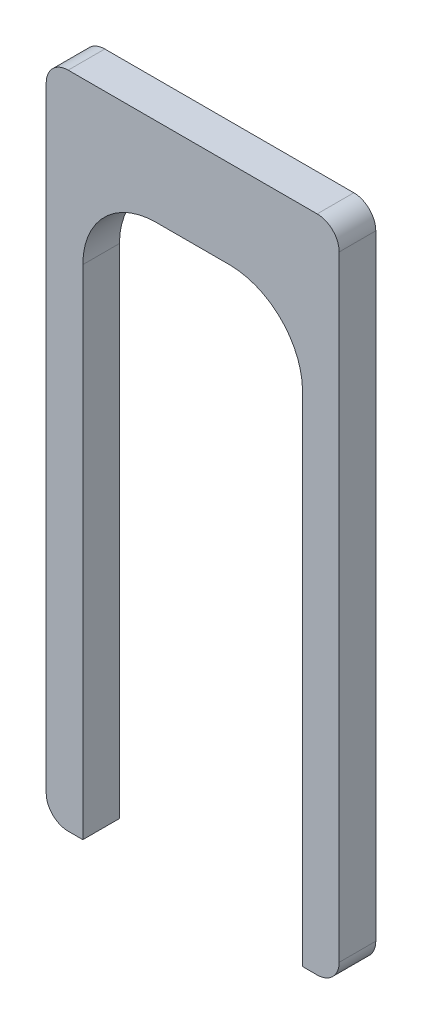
ISO-10303-21;
HEADER;
FILE_DESCRIPTION(('STEP AP214'),'2;1');
FILE_NAME('part.step','',(''),(''),'','','');
FILE_SCHEMA(('AUTOMOTIVE_DESIGN { 1 0 10303 214 1 1 1 1 }'));
ENDSEC;
DATA;
#1=APPLICATION_CONTEXT('core data for automotive mechanical design processes');
#2=APPLICATION_PROTOCOL_DEFINITION('international standard','automotive_design',2000,#1);
#3=PRODUCT_CONTEXT('',#1,'mechanical');
#4=PRODUCT('Part','Part','',(#3));
#5=PRODUCT_RELATED_PRODUCT_CATEGORY('part','',(#4));
#6=PRODUCT_DEFINITION_FORMATION('','',#4);
#7=PRODUCT_DEFINITION_CONTEXT('part definition',#1,'design');
#8=PRODUCT_DEFINITION('design','',#6,#7);
#9=PRODUCT_DEFINITION_SHAPE('','',#8);
#10=(LENGTH_UNIT() NAMED_UNIT(*) SI_UNIT(.MILLI.,.METRE.));
#11=(NAMED_UNIT(*) PLANE_ANGLE_UNIT() SI_UNIT($,.RADIAN.));
#12=(NAMED_UNIT(*) SI_UNIT($,.STERADIAN.) SOLID_ANGLE_UNIT());
#13=UNCERTAINTY_MEASURE_WITH_UNIT(LENGTH_MEASURE(1.E-05),#10,'distance_accuracy_value','');
#14=(GEOMETRIC_REPRESENTATION_CONTEXT(3) GLOBAL_UNCERTAINTY_ASSIGNED_CONTEXT((#13)) GLOBAL_UNIT_ASSIGNED_CONTEXT((#10,
#11,#12)) REPRESENTATION_CONTEXT('',''));
#15=CARTESIAN_POINT('',(0.,0.,0.));
#16=DIRECTION('',(0.,0.,1.));
#17=DIRECTION('',(1.,0.,0.));
#18=AXIS2_PLACEMENT_3D('',#15,#16,#17);
#19=CARTESIAN_POINT('',(20.,-45.,2.5));
#20=DIRECTION('',(0.,1.,0.));
#21=DIRECTION('',(-1.,0.,0.));
#22=AXIS2_PLACEMENT_3D('',#19,#20,#21);
#23=PLANE('',#22);
#24=DIRECTION('',(1.,0.,0.));
#25=VECTOR('',#24,1.);
#26=CARTESIAN_POINT('',(20.,-45.,-2.5));
#27=LINE('',#26,#25);
#28=CARTESIAN_POINT('',(-17.,-45.,-2.5));
#29=VERTEX_POINT('',#28);
#30=CARTESIAN_POINT('',(-15.,-45.,-2.5));
#31=VERTEX_POINT('',#30);
#32=EDGE_CURVE('E136',#29,#31,#27,.T.);
#33=ORIENTED_EDGE('',*,*,#32,.T.);
#34=DIRECTION('',(0.,0.,1.));
#35=VECTOR('',#34,1.);
#36=CARTESIAN_POINT('',(-15.,-45.,-2.5));
#37=LINE('',#36,#35);
#38=CARTESIAN_POINT('',(-15.,-45.,2.5));
#39=VERTEX_POINT('',#38);
#40=EDGE_CURVE('E142',#31,#39,#37,.T.);
#41=ORIENTED_EDGE('',*,*,#40,.T.);
#42=DIRECTION('',(1.,0.,0.));
#43=VECTOR('',#42,1.);
#44=CARTESIAN_POINT('',(20.,-45.,2.5));
#45=LINE('',#44,#43);
#46=CARTESIAN_POINT('',(-17.,-45.,2.5));
#47=VERTEX_POINT('',#46);
#48=EDGE_CURVE('E259',#47,#39,#45,.T.);
#49=ORIENTED_EDGE('',*,*,#48,.F.);
#50=DIRECTION('',(0.,0.,-1.));
#51=VECTOR('',#50,1.);
#52=CARTESIAN_POINT('',(-17.,-45.,2.5));
#53=LINE('',#52,#51);
#54=EDGE_CURVE('E154',#47,#29,#53,.T.);
#55=ORIENTED_EDGE('',*,*,#54,.T.);
#56=EDGE_LOOP('',(#33,#41,#49,#55));
#57=FACE_BOUND('',#56,.T.);
#58=ADVANCED_FACE('F33',(#57),#23,.F.);
#59=CARTESIAN_POINT('',(-20.,-45.,2.5));
#60=DIRECTION('',(1.,0.,0.));
#61=DIRECTION('',(0.,0.,-1.));
#62=AXIS2_PLACEMENT_3D('',#59,#60,#61);
#63=PLANE('',#62);
#64=DIRECTION('',(0.,-1.,0.));
#65=VECTOR('',#64,1.);
#66=CARTESIAN_POINT('',(-20.,-45.,-2.5));
#67=LINE('',#66,#65);
#68=CARTESIAN_POINT('',(-20.,42.,-2.5));
#69=VERTEX_POINT('',#68);
#70=CARTESIAN_POINT('',(-20.,-42.,-2.5));
#71=VERTEX_POINT('',#70);
#72=EDGE_CURVE('E161',#69,#71,#67,.T.);
#73=ORIENTED_EDGE('',*,*,#72,.T.);
#74=DIRECTION('',(0.,0.,-1.));
#75=VECTOR('',#74,1.);
#76=CARTESIAN_POINT('',(-20.,-42.,2.5));
#77=LINE('',#76,#75);
#78=CARTESIAN_POINT('',(-20.,-42.,2.5));
#79=VERTEX_POINT('',#78);
#80=EDGE_CURVE('E185',#71,#79,#77,.F.);
#81=ORIENTED_EDGE('',*,*,#80,.T.);
#82=DIRECTION('',(0.,-1.,0.));
#83=VECTOR('',#82,1.);
#84=CARTESIAN_POINT('',(-20.,-45.,2.5));
#85=LINE('',#84,#83);
#86=CARTESIAN_POINT('',(-20.,42.,2.5));
#87=VERTEX_POINT('',#86);
#88=EDGE_CURVE('E167',#87,#79,#85,.T.);
#89=ORIENTED_EDGE('',*,*,#88,.F.);
#90=DIRECTION('',(0.,0.,-1.));
#91=VECTOR('',#90,1.);
#92=CARTESIAN_POINT('',(-20.,42.,2.5));
#93=LINE('',#92,#91);
#94=EDGE_CURVE('E182',#87,#69,#93,.T.);
#95=ORIENTED_EDGE('',*,*,#94,.T.);
#96=EDGE_LOOP('',(#73,#81,#89,#95));
#97=FACE_BOUND('',#96,.T.);
#98=ADVANCED_FACE('F235',(#97),#63,.F.);
#99=CARTESIAN_POINT('',(15.,-45.,2.5));
#100=VERTEX_POINT('',#99);
#101=CARTESIAN_POINT('',(17.,-45.,2.5));
#102=VERTEX_POINT('',#101);
#103=EDGE_CURVE('E254',#100,#102,#45,.T.);
#104=ORIENTED_EDGE('',*,*,#103,.F.);
#105=DIRECTION('',(0.,0.,1.));
#106=VECTOR('',#105,1.);
#107=CARTESIAN_POINT('',(15.,-45.,-2.5));
#108=LINE('',#107,#106);
#109=CARTESIAN_POINT('',(15.,-45.,-2.5));
#110=VERTEX_POINT('',#109);
#111=EDGE_CURVE('E149',#110,#100,#108,.T.);
#112=ORIENTED_EDGE('',*,*,#111,.F.);
#113=CARTESIAN_POINT('',(17.,-45.,-2.5));
#114=VERTEX_POINT('',#113);
#115=EDGE_CURVE('E156',#110,#114,#27,.T.);
#116=ORIENTED_EDGE('',*,*,#115,.T.);
#117=DIRECTION('',(0.,0.,-1.));
#118=VECTOR('',#117,1.);
#119=CARTESIAN_POINT('',(17.,-45.,2.5));
#120=LINE('',#119,#118);
#121=EDGE_CURVE('E168',#114,#102,#120,.F.);
#122=ORIENTED_EDGE('',*,*,#121,.T.);
#123=EDGE_LOOP('',(#104,#112,#116,#122));
#124=FACE_BOUND('',#123,.T.);
#125=ADVANCED_FACE('F237',(#124),#23,.F.);
#126=CARTESIAN_POINT('',(20.,-45.,2.5));
#127=DIRECTION('',(-1.,0.,0.));
#128=DIRECTION('',(0.,0.,1.));
#129=AXIS2_PLACEMENT_3D('',#126,#127,#128);
#130=PLANE('',#129);
#131=DIRECTION('',(0.,1.,0.));
#132=VECTOR('',#131,1.);
#133=CARTESIAN_POINT('',(20.,-45.,2.5));
#134=LINE('',#133,#132);
#135=CARTESIAN_POINT('',(20.,-42.,2.5));
#136=VERTEX_POINT('',#135);
#137=CARTESIAN_POINT('',(20.,42.,2.5));
#138=VERTEX_POINT('',#137);
#139=EDGE_CURVE('E261',#136,#138,#134,.T.);
#140=ORIENTED_EDGE('',*,*,#139,.F.);
#141=DIRECTION('',(0.,0.,-1.));
#142=VECTOR('',#141,1.);
#143=CARTESIAN_POINT('',(20.,-42.,2.5));
#144=LINE('',#143,#142);
#145=CARTESIAN_POINT('',(20.,-42.,-2.5));
#146=VERTEX_POINT('',#145);
#147=EDGE_CURVE('E197',#136,#146,#144,.T.);
#148=ORIENTED_EDGE('',*,*,#147,.T.);
#149=DIRECTION('',(0.,1.,0.));
#150=VECTOR('',#149,1.);
#151=CARTESIAN_POINT('',(20.,-45.,-2.5));
#152=LINE('',#151,#150);
#153=CARTESIAN_POINT('',(20.,42.,-2.5));
#154=VERTEX_POINT('',#153);
#155=EDGE_CURVE('E155',#146,#154,#152,.T.);
#156=ORIENTED_EDGE('',*,*,#155,.T.);
#157=DIRECTION('',(0.,0.,-1.));
#158=VECTOR('',#157,1.);
#159=CARTESIAN_POINT('',(20.,42.,2.5));
#160=LINE('',#159,#158);
#161=EDGE_CURVE('E195',#154,#138,#160,.F.);
#162=ORIENTED_EDGE('',*,*,#161,.T.);
#163=EDGE_LOOP('',(#140,#148,#156,#162));
#164=FACE_BOUND('',#163,.T.);
#165=ADVANCED_FACE('F245',(#164),#130,.F.);
#166=CARTESIAN_POINT('',(20.,45.,2.5));
#167=DIRECTION('',(0.,-1.,0.));
#168=DIRECTION('',(0.,0.,-1.));
#169=AXIS2_PLACEMENT_3D('',#166,#167,#168);
#170=PLANE('',#169);
#171=DIRECTION('',(-1.,0.,0.));
#172=VECTOR('',#171,1.);
#173=CARTESIAN_POINT('',(20.,45.,2.5));
#174=LINE('',#173,#172);
#175=CARTESIAN_POINT('',(17.,45.,2.5));
#176=VERTEX_POINT('',#175);
#177=CARTESIAN_POINT('',(-17.,45.,2.5));
#178=VERTEX_POINT('',#177);
#179=EDGE_CURVE('E171',#176,#178,#174,.T.);
#180=ORIENTED_EDGE('',*,*,#179,.F.);
#181=DIRECTION('',(0.,0.,-1.));
#182=VECTOR('',#181,1.);
#183=CARTESIAN_POINT('',(17.,45.,2.5));
#184=LINE('',#183,#182);
#185=CARTESIAN_POINT('',(17.,45.,-2.5));
#186=VERTEX_POINT('',#185);
#187=EDGE_CURVE('E202',#176,#186,#184,.T.);
#188=ORIENTED_EDGE('',*,*,#187,.T.);
#189=DIRECTION('',(-1.,0.,0.));
#190=VECTOR('',#189,1.);
#191=CARTESIAN_POINT('',(20.,45.,-2.5));
#192=LINE('',#191,#190);
#193=CARTESIAN_POINT('',(-17.,45.,-2.5));
#194=VERTEX_POINT('',#193);
#195=EDGE_CURVE('E159',#186,#194,#192,.T.);
#196=ORIENTED_EDGE('',*,*,#195,.T.);
#197=DIRECTION('',(0.,0.,-1.));
#198=VECTOR('',#197,1.);
#199=CARTESIAN_POINT('',(-17.,45.,2.5));
#200=LINE('',#199,#198);
#201=EDGE_CURVE('E200',#194,#178,#200,.F.);
#202=ORIENTED_EDGE('',*,*,#201,.T.);
#203=EDGE_LOOP('',(#180,#188,#196,#202));
#204=FACE_BOUND('',#203,.T.);
#205=ADVANCED_FACE('F250',(#204),#170,.F.);
#206=CARTESIAN_POINT('',(0.,0.,2.5));
#207=DIRECTION('',(0.,0.,1.));
#208=DIRECTION('',(1.,0.,0.));
#209=AXIS2_PLACEMENT_3D('',#206,#207,#208);
#210=PLANE('',#209);
#211=DIRECTION('',(0.,-1.,0.));
#212=VECTOR('',#211,1.);
#213=CARTESIAN_POINT('',(-15.,-45.,2.5));
#214=LINE('',#213,#212);
#215=CARTESIAN_POINT('',(-15.,23.,2.5));
#216=VERTEX_POINT('',#215);
#217=EDGE_CURVE('E145',#216,#39,#214,.T.);
#218=ORIENTED_EDGE('',*,*,#217,.F.);
#219=CARTESIAN_POINT('',(-5.,23.,2.5));
#220=DIRECTION('',(0.,0.,1.));
#221=DIRECTION('',(1.,0.,0.));
#222=AXIS2_PLACEMENT_3D('',#219,#220,#221);
#223=CIRCLE('',#222,10.);
#224=CARTESIAN_POINT('',(-5.,33.,2.5));
#225=VERTEX_POINT('',#224);
#226=EDGE_CURVE('E41',#216,#225,#223,.F.);
#227=ORIENTED_EDGE('',*,*,#226,.T.);
#228=DIRECTION('',(-1.,0.,0.));
#229=VECTOR('',#228,1.);
#230=CARTESIAN_POINT('',(15.,33.,2.5));
#231=LINE('',#230,#229);
#232=CARTESIAN_POINT('',(5.,33.,2.5));
#233=VERTEX_POINT('',#232);
#234=EDGE_CURVE('E139',#233,#225,#231,.T.);
#235=ORIENTED_EDGE('',*,*,#234,.F.);
#236=CARTESIAN_POINT('',(5.,23.,2.5));
#237=DIRECTION('',(0.,0.,1.));
#238=DIRECTION('',(1.,0.,0.));
#239=AXIS2_PLACEMENT_3D('',#236,#237,#238);
#240=CIRCLE('',#239,10.);
#241=CARTESIAN_POINT('',(15.,23.,2.5));
#242=VERTEX_POINT('',#241);
#243=EDGE_CURVE('E214',#233,#242,#240,.F.);
#244=ORIENTED_EDGE('',*,*,#243,.T.);
#245=DIRECTION('',(0.,1.,0.));
#246=VECTOR('',#245,1.);
#247=CARTESIAN_POINT('',(15.,-45.,2.5));
#248=LINE('',#247,#246);
#249=EDGE_CURVE('E225',#100,#242,#248,.T.);
#250=ORIENTED_EDGE('',*,*,#249,.F.);
#251=ORIENTED_EDGE('',*,*,#103,.T.);
#252=CARTESIAN_POINT('',(17.,-42.,2.5));
#253=DIRECTION('',(0.,0.,1.));
#254=DIRECTION('',(1.,0.,0.));
#255=AXIS2_PLACEMENT_3D('',#252,#253,#254);
#256=CIRCLE('',#255,3.);
#257=EDGE_CURVE('E191',#102,#136,#256,.T.);
#258=ORIENTED_EDGE('',*,*,#257,.T.);
#259=ORIENTED_EDGE('',*,*,#139,.T.);
#260=CARTESIAN_POINT('',(17.,42.,2.5));
#261=DIRECTION('',(0.,0.,1.));
#262=DIRECTION('',(1.,0.,0.));
#263=AXIS2_PLACEMENT_3D('',#260,#261,#262);
#264=CIRCLE('',#263,3.);
#265=EDGE_CURVE('E189',#138,#176,#264,.T.);
#266=ORIENTED_EDGE('',*,*,#265,.T.);
#267=ORIENTED_EDGE('',*,*,#179,.T.);
#268=CARTESIAN_POINT('',(-17.,42.,2.5));
#269=DIRECTION('',(0.,0.,1.));
#270=DIRECTION('',(1.,0.,0.));
#271=AXIS2_PLACEMENT_3D('',#268,#269,#270);
#272=CIRCLE('',#271,3.);
#273=EDGE_CURVE('E187',#178,#87,#272,.T.);
#274=ORIENTED_EDGE('',*,*,#273,.T.);
#275=ORIENTED_EDGE('',*,*,#88,.T.);
#276=CARTESIAN_POINT('',(-17.,-42.,2.5));
#277=DIRECTION('',(0.,0.,1.));
#278=DIRECTION('',(1.,0.,0.));
#279=AXIS2_PLACEMENT_3D('',#276,#277,#278);
#280=CIRCLE('',#279,3.);
#281=EDGE_CURVE('E193',#79,#47,#280,.T.);
#282=ORIENTED_EDGE('',*,*,#281,.T.);
#283=ORIENTED_EDGE('',*,*,#48,.T.);
#284=EDGE_LOOP('',(#218,#227,#235,#244,#250,#251,#258,#259,#266,#267,#274,#275,#282,#283));
#285=FACE_BOUND('',#284,.T.);
#286=ADVANCED_FACE('F220',(#285),#210,.T.);
#287=CARTESIAN_POINT('',(0.,0.,-2.5));
#288=DIRECTION('',(0.,0.,1.));
#289=DIRECTION('',(1.,0.,0.));
#290=AXIS2_PLACEMENT_3D('',#287,#288,#289);
#291=PLANE('',#290);
#292=DIRECTION('',(0.,1.,0.));
#293=VECTOR('',#292,1.);
#294=CARTESIAN_POINT('',(15.,-45.,-2.5));
#295=LINE('',#294,#293);
#296=CARTESIAN_POINT('',(15.,23.,-2.5));
#297=VERTEX_POINT('',#296);
#298=EDGE_CURVE('E138',#110,#297,#295,.T.);
#299=ORIENTED_EDGE('',*,*,#298,.T.);
#300=CARTESIAN_POINT('',(5.,23.,-2.5));
#301=DIRECTION('',(0.,0.,1.));
#302=DIRECTION('',(1.,0.,0.));
#303=AXIS2_PLACEMENT_3D('',#300,#301,#302);
#304=CIRCLE('',#303,10.);
#305=CARTESIAN_POINT('',(5.,33.,-2.5));
#306=VERTEX_POINT('',#305);
#307=EDGE_CURVE('E216',#297,#306,#304,.T.);
#308=ORIENTED_EDGE('',*,*,#307,.T.);
#309=DIRECTION('',(-1.,0.,0.));
#310=VECTOR('',#309,1.);
#311=CARTESIAN_POINT('',(15.,33.,-2.5));
#312=LINE('',#311,#310);
#313=CARTESIAN_POINT('',(-5.,33.,-2.5));
#314=VERTEX_POINT('',#313);
#315=EDGE_CURVE('E150',#306,#314,#312,.T.);
#316=ORIENTED_EDGE('',*,*,#315,.T.);
#317=CARTESIAN_POINT('',(-5.,23.,-2.5));
#318=DIRECTION('',(0.,0.,1.));
#319=DIRECTION('',(1.,0.,0.));
#320=AXIS2_PLACEMENT_3D('',#317,#318,#319);
#321=CIRCLE('',#320,10.);
#322=CARTESIAN_POINT('',(-15.,23.,-2.5));
#323=VERTEX_POINT('',#322);
#324=EDGE_CURVE('E11',#314,#323,#321,.T.);
#325=ORIENTED_EDGE('',*,*,#324,.T.);
#326=DIRECTION('',(0.,-1.,0.));
#327=VECTOR('',#326,1.);
#328=CARTESIAN_POINT('',(-15.,-45.,-2.5));
#329=LINE('',#328,#327);
#330=EDGE_CURVE('E131',#323,#31,#329,.T.);
#331=ORIENTED_EDGE('',*,*,#330,.T.);
#332=ORIENTED_EDGE('',*,*,#32,.F.);
#333=CARTESIAN_POINT('',(-17.,-42.,-2.5));
#334=DIRECTION('',(0.,0.,1.));
#335=DIRECTION('',(1.,0.,0.));
#336=AXIS2_PLACEMENT_3D('',#333,#334,#335);
#337=CIRCLE('',#336,3.);
#338=EDGE_CURVE('E180',#29,#71,#337,.F.);
#339=ORIENTED_EDGE('',*,*,#338,.T.);
#340=ORIENTED_EDGE('',*,*,#72,.F.);
#341=CARTESIAN_POINT('',(-17.,42.,-2.5));
#342=DIRECTION('',(0.,0.,1.));
#343=DIRECTION('',(1.,0.,0.));
#344=AXIS2_PLACEMENT_3D('',#341,#342,#343);
#345=CIRCLE('',#344,3.);
#346=EDGE_CURVE('E173',#69,#194,#345,.F.);
#347=ORIENTED_EDGE('',*,*,#346,.T.);
#348=ORIENTED_EDGE('',*,*,#195,.F.);
#349=CARTESIAN_POINT('',(17.,42.,-2.5));
#350=DIRECTION('',(0.,0.,1.));
#351=DIRECTION('',(1.,0.,0.));
#352=AXIS2_PLACEMENT_3D('',#349,#350,#351);
#353=CIRCLE('',#352,3.);
#354=EDGE_CURVE('E175',#186,#154,#353,.F.);
#355=ORIENTED_EDGE('',*,*,#354,.T.);
#356=ORIENTED_EDGE('',*,*,#155,.F.);
#357=CARTESIAN_POINT('',(17.,-42.,-2.5));
#358=DIRECTION('',(0.,0.,1.));
#359=DIRECTION('',(1.,0.,0.));
#360=AXIS2_PLACEMENT_3D('',#357,#358,#359);
#361=CIRCLE('',#360,3.);
#362=EDGE_CURVE('E177',#146,#114,#361,.F.);
#363=ORIENTED_EDGE('',*,*,#362,.T.);
#364=ORIENTED_EDGE('',*,*,#115,.F.);
#365=EDGE_LOOP('',(#299,#308,#316,#325,#331,#332,#339,#340,#347,#348,#355,#356,#363,#364));
#366=FACE_BOUND('',#365,.T.);
#367=ADVANCED_FACE('F134',(#366),#291,.F.);
#368=CARTESIAN_POINT('',(-17.,-42.,2.5));
#369=DIRECTION('',(0.,0.,-1.));
#370=DIRECTION('',(-1.,0.,0.));
#371=AXIS2_PLACEMENT_3D('',#368,#369,#370);
#372=CYLINDRICAL_SURFACE('',#371,3.);
#373=ORIENTED_EDGE('',*,*,#281,.F.);
#374=ORIENTED_EDGE('',*,*,#80,.F.);
#375=ORIENTED_EDGE('',*,*,#338,.F.);
#376=ORIENTED_EDGE('',*,*,#54,.F.);
#377=EDGE_LOOP('',(#373,#374,#375,#376));
#378=FACE_BOUND('',#377,.T.);
#379=ADVANCED_FACE('F303',(#378),#372,.T.);
#380=CARTESIAN_POINT('',(17.,-42.,2.5));
#381=DIRECTION('',(0.,0.,-1.));
#382=DIRECTION('',(-1.,0.,0.));
#383=AXIS2_PLACEMENT_3D('',#380,#381,#382);
#384=CYLINDRICAL_SURFACE('',#383,3.);
#385=ORIENTED_EDGE('',*,*,#257,.F.);
#386=ORIENTED_EDGE('',*,*,#121,.F.);
#387=ORIENTED_EDGE('',*,*,#362,.F.);
#388=ORIENTED_EDGE('',*,*,#147,.F.);
#389=EDGE_LOOP('',(#385,#386,#387,#388));
#390=FACE_BOUND('',#389,.T.);
#391=ADVANCED_FACE('F324',(#390),#384,.T.);
#392=CARTESIAN_POINT('',(17.,42.,2.5));
#393=DIRECTION('',(0.,0.,-1.));
#394=DIRECTION('',(-1.,0.,0.));
#395=AXIS2_PLACEMENT_3D('',#392,#393,#394);
#396=CYLINDRICAL_SURFACE('',#395,3.);
#397=ORIENTED_EDGE('',*,*,#265,.F.);
#398=ORIENTED_EDGE('',*,*,#161,.F.);
#399=ORIENTED_EDGE('',*,*,#354,.F.);
#400=ORIENTED_EDGE('',*,*,#187,.F.);
#401=EDGE_LOOP('',(#397,#398,#399,#400));
#402=FACE_BOUND('',#401,.T.);
#403=ADVANCED_FACE('F332',(#402),#396,.T.);
#404=CARTESIAN_POINT('',(-17.,42.,2.5));
#405=DIRECTION('',(0.,0.,-1.));
#406=DIRECTION('',(-1.,0.,0.));
#407=AXIS2_PLACEMENT_3D('',#404,#405,#406);
#408=CYLINDRICAL_SURFACE('',#407,3.);
#409=ORIENTED_EDGE('',*,*,#273,.F.);
#410=ORIENTED_EDGE('',*,*,#201,.F.);
#411=ORIENTED_EDGE('',*,*,#346,.F.);
#412=ORIENTED_EDGE('',*,*,#94,.F.);
#413=EDGE_LOOP('',(#409,#410,#411,#412));
#414=FACE_BOUND('',#413,.T.);
#415=ADVANCED_FACE('F276',(#414),#408,.T.);
#416=CARTESIAN_POINT('',(-15.,-45.,-2.5));
#417=DIRECTION('',(-1.,0.,0.));
#418=DIRECTION('',(0.,0.,1.));
#419=AXIS2_PLACEMENT_3D('',#416,#417,#418);
#420=PLANE('',#419);
#421=ORIENTED_EDGE('',*,*,#330,.F.);
#422=DIRECTION('',(0.,0.,1.));
#423=VECTOR('',#422,1.);
#424=CARTESIAN_POINT('',(-15.,23.,2.5));
#425=LINE('',#424,#423);
#426=EDGE_CURVE('E212',#323,#216,#425,.T.);
#427=ORIENTED_EDGE('',*,*,#426,.T.);
#428=ORIENTED_EDGE('',*,*,#217,.T.);
#429=ORIENTED_EDGE('',*,*,#40,.F.);
#430=EDGE_LOOP('',(#421,#427,#428,#429));
#431=FACE_BOUND('',#430,.T.);
#432=ADVANCED_FACE('F143',(#431),#420,.F.);
#433=CARTESIAN_POINT('',(15.,33.,-2.5));
#434=DIRECTION('',(0.,1.,0.));
#435=DIRECTION('',(0.,0.,1.));
#436=AXIS2_PLACEMENT_3D('',#433,#434,#435);
#437=PLANE('',#436);
#438=ORIENTED_EDGE('',*,*,#315,.F.);
#439=DIRECTION('',(0.,0.,1.));
#440=VECTOR('',#439,1.);
#441=CARTESIAN_POINT('',(5.,33.,2.5));
#442=LINE('',#441,#440);
#443=EDGE_CURVE('E207',#306,#233,#442,.T.);
#444=ORIENTED_EDGE('',*,*,#443,.T.);
#445=ORIENTED_EDGE('',*,*,#234,.T.);
#446=DIRECTION('',(0.,0.,1.));
#447=VECTOR('',#446,1.);
#448=CARTESIAN_POINT('',(-5.,33.,-2.5));
#449=LINE('',#448,#447);
#450=EDGE_CURVE('E205',#225,#314,#449,.F.);
#451=ORIENTED_EDGE('',*,*,#450,.T.);
#452=EDGE_LOOP('',(#438,#444,#445,#451));
#453=FACE_BOUND('',#452,.T.);
#454=ADVANCED_FACE('F223',(#453),#437,.F.);
#455=CARTESIAN_POINT('',(15.,-45.,-2.5));
#456=DIRECTION('',(1.,0.,0.));
#457=DIRECTION('',(0.,0.,-1.));
#458=AXIS2_PLACEMENT_3D('',#455,#456,#457);
#459=PLANE('',#458);
#460=ORIENTED_EDGE('',*,*,#249,.T.);
#461=DIRECTION('',(0.,0.,1.));
#462=VECTOR('',#461,1.);
#463=CARTESIAN_POINT('',(15.,23.,-2.5));
#464=LINE('',#463,#462);
#465=EDGE_CURVE('E210',#242,#297,#464,.F.);
#466=ORIENTED_EDGE('',*,*,#465,.T.);
#467=ORIENTED_EDGE('',*,*,#298,.F.);
#468=ORIENTED_EDGE('',*,*,#111,.T.);
#469=EDGE_LOOP('',(#460,#466,#467,#468));
#470=FACE_BOUND('',#469,.T.);
#471=ADVANCED_FACE('F232',(#470),#459,.F.);
#472=CARTESIAN_POINT('',(5.,23.,-2.5));
#473=DIRECTION('',(0.,0.,-1.));
#474=DIRECTION('',(-1.,0.,0.));
#475=AXIS2_PLACEMENT_3D('',#472,#473,#474);
#476=CYLINDRICAL_SURFACE('',#475,10.);
#477=ORIENTED_EDGE('',*,*,#307,.F.);
#478=ORIENTED_EDGE('',*,*,#465,.F.);
#479=ORIENTED_EDGE('',*,*,#243,.F.);
#480=ORIENTED_EDGE('',*,*,#443,.F.);
#481=EDGE_LOOP('',(#477,#478,#479,#480));
#482=FACE_BOUND('',#481,.T.);
#483=ADVANCED_FACE('F228',(#482),#476,.F.);
#484=CARTESIAN_POINT('',(-5.,23.,-2.5));
#485=DIRECTION('',(0.,0.,-1.));
#486=DIRECTION('',(-1.,0.,0.));
#487=AXIS2_PLACEMENT_3D('',#484,#485,#486);
#488=CYLINDRICAL_SURFACE('',#487,10.);
#489=ORIENTED_EDGE('',*,*,#324,.F.);
#490=ORIENTED_EDGE('',*,*,#450,.F.);
#491=ORIENTED_EDGE('',*,*,#226,.F.);
#492=ORIENTED_EDGE('',*,*,#426,.F.);
#493=EDGE_LOOP('',(#489,#490,#491,#492));
#494=FACE_BOUND('',#493,.T.);
#495=ADVANCED_FACE('F35',(#494),#488,.F.);
#496=CLOSED_SHELL('',(#58,#98,#125,#165,#205,#286,#367,#379,#391,#403,#415,#432,#454,#471,#483,#495));
#497=MANIFOLD_SOLID_BREP('B2',#496);
#498=ADVANCED_BREP_SHAPE_REPRESENTATION('',(#18,#497),#14);
#499=SHAPE_DEFINITION_REPRESENTATION(#9,#498);
ENDSEC;
END-ISO-10303-21;
